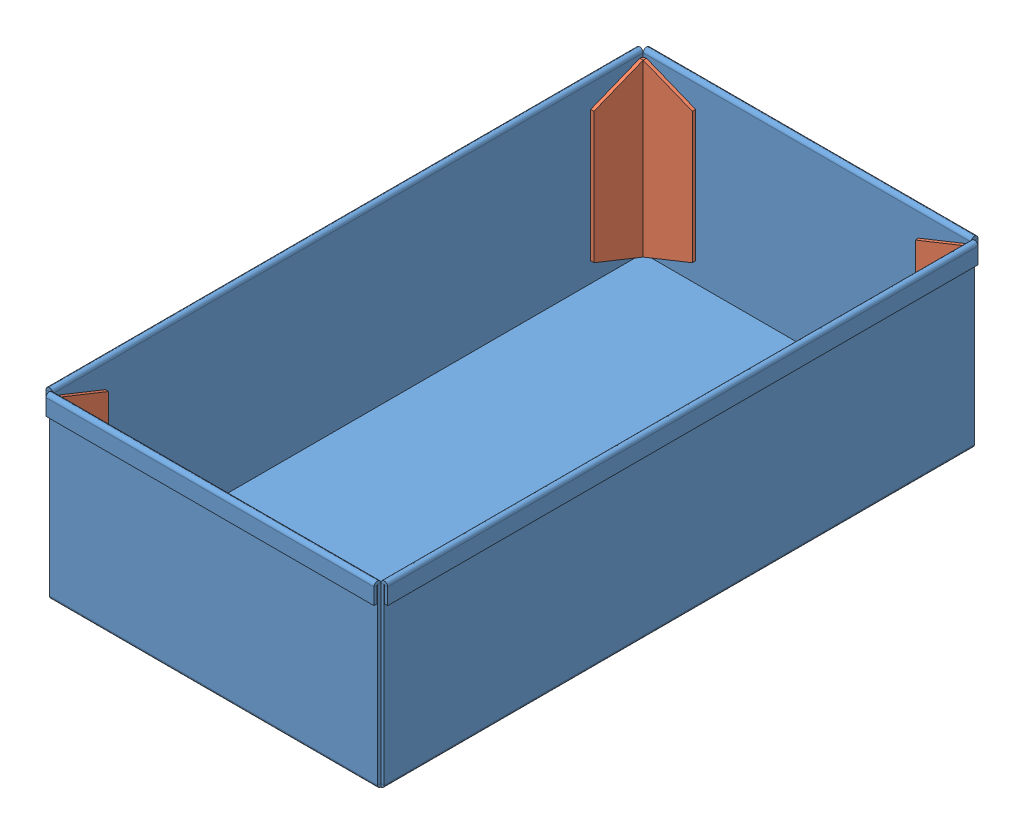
SolidWorks assembly SimpleBox.SLDASM, configuration Default (file format 4100). Lengths in mm.
Overall size (104.2 55 184.2).
5 component instances, 2 part files, 11 mates.
Components (placement in the parent):
- SimpleBoxBody-1: SimpleBoxBody.SLDPRT [Default] at (-50.8832 -15.5202 82.3274) size (104.2 55 184.2)
- SimpleBoxCorner-1: SimpleBoxCorner.SLDPRT [Default] at (-49.8832 -14.5202 -97.6736) size (16 52.01 16)
- SimpleBoxCorner-2: SimpleBoxCorner.SLDPRT [Default] at (49.1178 -14.5202 -96.6726) x (0 0 1) z (-1 0 0) size (16 52.01 16)
- SimpleBoxCorner-3: SimpleBoxCorner.SLDPRT [Default] at (48.1168 -14.5202 82.3284) x (-1 0 0) z (0 0 -1) size (16 52.01 16)
- SimpleBoxCorner-4: SimpleBoxCorner.SLDPRT [Default] at (-50.8842 -14.5202 81.3274) x (0 0 -1) z (1 0 0) size (16 52.01 16)
Mates (geometry in assembly coordinates):
- Coincident1: coincident: plane of SimpleBoxBody-1 through (-50.8842 39.4792 82.3274) normal (1 0 0); plane of SimpleBoxCorner-1 through (-50.8842 2.0404 -111.6742) normal (-1 0 0)
- Coincident2: coincident: plane of SimpleBoxBody-1 through (-104.8832 -194.5208 -97.6736) normal (0 0 1); plane of SimpleBoxCorner-1 through (-34.8832 2.0404 -97.6736) normal (0 0 -1)
- Coincident3: coincident: plane of SimpleBoxBody-1 through (49.1178 -168.5208 82.3274) normal (-1 0 0); plane of SimpleBoxCorner-2 through (49.1178 22.7487 -81.6726) normal (1 0 0)
- Coincident4: coincident: plane of SimpleBoxBody-1 through (-104.8832 -194.5208 -97.6736) normal (0 0 1); plane of SimpleBoxCorner-2 through (63.1183 22.7487 -97.6736) normal (0 0 -1)
- Coincident5: coincident: plane of SimpleBoxBody-1 through (-50.8842 39.4792 82.3274) normal (1 0 0); plane of SimpleBoxCorner-4 through (-50.8842 41.0248 66.3274) normal (-1 0 0)
- Coincident6: coincident: plane of SimpleBoxBody-1 through (-104.8832 -14.5208 82.3284) normal (0 0 -1); plane of SimpleBoxCorner-4 through (-64.8848 41.0248 82.3284) normal (0 0 1)
- Coincident7: coincident: plane of SimpleBoxCorner-3 through (49.1178 36.8266 96.329) normal (1 0 0); plane of SimpleBoxBody-1 through (49.1178 -168.5208 82.3274) normal (-1 0 0)
- Distance1: distance = 6 mm: line of SimpleBoxCorner-1 through (-34.8832 -8.5202 -96.6736) axis (0 0 -1); plane of SimpleBoxBody-1 through (-104.8832 -14.5202 82.3274) normal (0 1 0)
- Distance2: distance = 6 mm: line of SimpleBoxCorner-4 through (-34.8848 -8.5202 81.3284) axis (0 0 1); plane of SimpleBoxBody-1 through (-104.8832 -14.5202 82.3274) normal (0 1 0)
- Distance3: distance = 6 mm: line of SimpleBoxCorner-3 through (33.1168 -8.5202 81.3284) axis (0 0 1); plane of SimpleBoxBody-1 through (-104.8832 -14.5202 82.3274) normal (0 1 0)
- Distance4: distance = 6 mm: line of SimpleBoxCorner-2 through (33.1183 -8.5202 -96.6736) axis (0 0 -1); plane of SimpleBoxBody-1 through (-104.8832 -14.5202 82.3274) normal (0 1 0)
